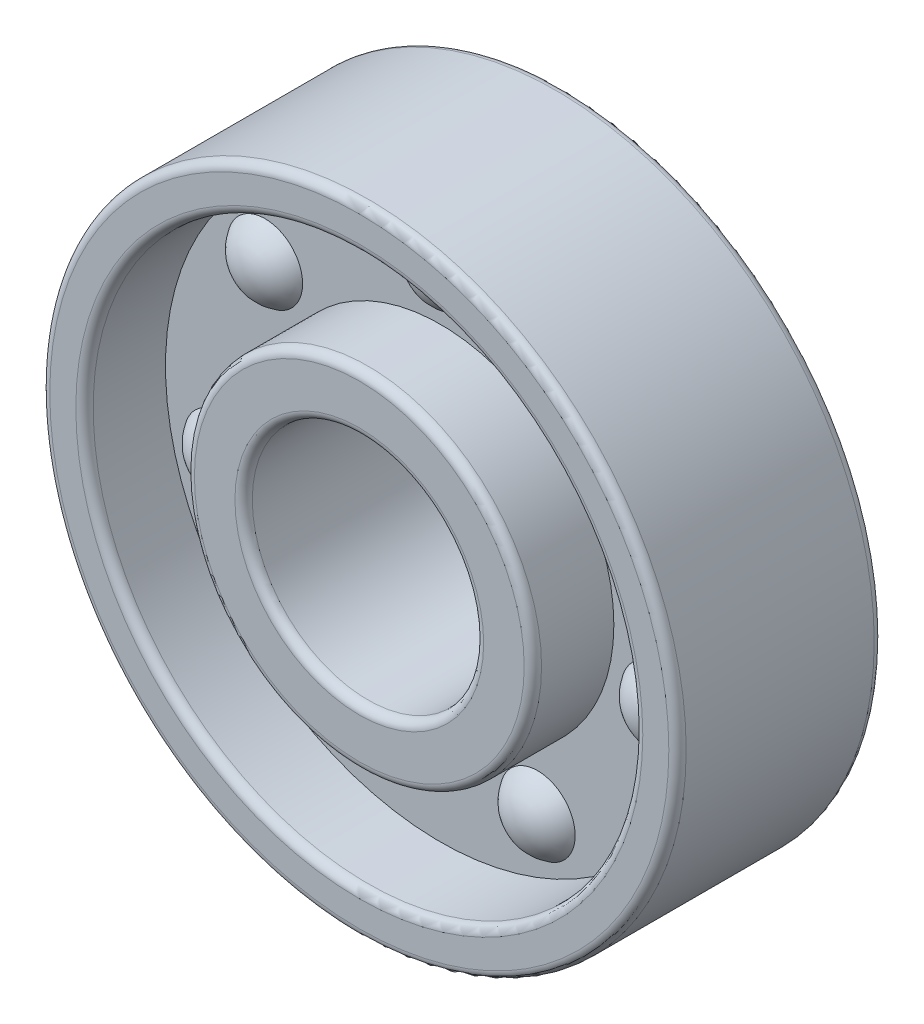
ISO-10303-21;
HEADER;
FILE_DESCRIPTION(('STEP AP214'),'2;1');
FILE_NAME('part.step','',(''),(''),'','','');
FILE_SCHEMA(('AUTOMOTIVE_DESIGN { 1 0 10303 214 1 1 1 1 }'));
ENDSEC;
DATA;
#1=APPLICATION_CONTEXT('core data for automotive mechanical design processes');
#2=APPLICATION_PROTOCOL_DEFINITION('international standard','automotive_design',2000,#1);
#3=PRODUCT_CONTEXT('',#1,'mechanical');
#4=PRODUCT('Part','Part','',(#3));
#5=PRODUCT_RELATED_PRODUCT_CATEGORY('part','',(#4));
#6=PRODUCT_DEFINITION_FORMATION('','',#4);
#7=PRODUCT_DEFINITION_CONTEXT('part definition',#1,'design');
#8=PRODUCT_DEFINITION('design','',#6,#7);
#9=PRODUCT_DEFINITION_SHAPE('','',#8);
#10=(LENGTH_UNIT() NAMED_UNIT(*) SI_UNIT(.MILLI.,.METRE.));
#11=(NAMED_UNIT(*) PLANE_ANGLE_UNIT() SI_UNIT($,.RADIAN.));
#12=(NAMED_UNIT(*) SI_UNIT($,.STERADIAN.) SOLID_ANGLE_UNIT());
#13=UNCERTAINTY_MEASURE_WITH_UNIT(LENGTH_MEASURE(1.E-05),#10,'distance_accuracy_value','');
#14=(GEOMETRIC_REPRESENTATION_CONTEXT(3) GLOBAL_UNCERTAINTY_ASSIGNED_CONTEXT((#13)) GLOBAL_UNIT_ASSIGNED_CONTEXT((#10,
#11,#12)) REPRESENTATION_CONTEXT('',''));
#15=CARTESIAN_POINT('',(0.,0.,0.));
#16=DIRECTION('',(0.,0.,1.));
#17=DIRECTION('',(1.,0.,0.));
#18=AXIS2_PLACEMENT_3D('',#15,#16,#17);
#19=CARTESIAN_POINT('',(0.,0.,7.1));
#20=DIRECTION('',(0.,0.,1.));
#21=DIRECTION('',(1.,0.,0.));
#22=AXIS2_PLACEMENT_3D('',#19,#20,#21);
#23=PLANE('',#22);
#24=CARTESIAN_POINT('',(0.,0.,7.1));
#25=DIRECTION('',(0.,0.,1.));
#26=DIRECTION('',(1.,0.,0.));
#27=AXIS2_PLACEMENT_3D('',#24,#25,#26);
#28=CIRCLE('',#27,9.8);
#29=CARTESIAN_POINT('',(9.8,0.,7.1));
#30=VERTEX_POINT('',#29);
#31=EDGE_CURVE('E74',#30,#30,#28,.F.);
#32=ORIENTED_EDGE('',*,*,#31,.T.);
#33=EDGE_LOOP('',(#32));
#34=FACE_BOUND('',#33,.T.);
#35=CARTESIAN_POINT('',(0.,0.,7.1));
#36=DIRECTION('',(0.,0.,1.));
#37=DIRECTION('',(1.,0.,0.));
#38=AXIS2_PLACEMENT_3D('',#35,#36,#37);
#39=CIRCLE('',#38,10.7);
#40=CARTESIAN_POINT('',(10.7,0.,7.1));
#41=VERTEX_POINT('',#40);
#42=EDGE_CURVE('E77',#41,#41,#39,.T.);
#43=ORIENTED_EDGE('',*,*,#42,.T.);
#44=EDGE_LOOP('',(#43));
#45=FACE_BOUND('',#44,.T.);
#46=ADVANCED_FACE('F39',(#34,#45),#23,.T.);
#47=CARTESIAN_POINT('',(0.,0.,0.));
#48=DIRECTION('',(0.,0.,1.));
#49=DIRECTION('',(1.,0.,0.));
#50=AXIS2_PLACEMENT_3D('',#47,#48,#49);
#51=PLANE('',#50);
#52=CARTESIAN_POINT('',(0.,0.,0.));
#53=DIRECTION('',(0.,0.,1.));
#54=DIRECTION('',(1.,0.,0.));
#55=AXIS2_PLACEMENT_3D('',#52,#53,#54);
#56=CIRCLE('',#55,9.8);
#57=CARTESIAN_POINT('',(9.8,0.,0.));
#58=VERTEX_POINT('',#57);
#59=EDGE_CURVE('E50',#58,#58,#56,.T.);
#60=ORIENTED_EDGE('',*,*,#59,.T.);
#61=EDGE_LOOP('',(#60));
#62=FACE_BOUND('',#61,.T.);
#63=CARTESIAN_POINT('',(0.,0.,0.));
#64=DIRECTION('',(0.,0.,1.));
#65=DIRECTION('',(1.,0.,0.));
#66=AXIS2_PLACEMENT_3D('',#63,#64,#65);
#67=CIRCLE('',#66,10.7);
#68=CARTESIAN_POINT('',(10.7,0.,0.));
#69=VERTEX_POINT('',#68);
#70=EDGE_CURVE('E54',#69,#69,#67,.F.);
#71=ORIENTED_EDGE('',*,*,#70,.T.);
#72=EDGE_LOOP('',(#71));
#73=FACE_BOUND('',#72,.T.);
#74=ADVANCED_FACE('F169',(#62,#73),#51,.F.);
#75=CARTESIAN_POINT('',(0.,0.,7.1));
#76=DIRECTION('',(0.,0.,-1.));
#77=DIRECTION('',(-1.,0.,0.));
#78=AXIS2_PLACEMENT_3D('',#75,#76,#77);
#79=CYLINDRICAL_SURFACE('',#78,11.);
#80=CARTESIAN_POINT('',(0.,0.,6.8));
#81=DIRECTION('',(0.,0.,1.));
#82=DIRECTION('',(1.,0.,0.));
#83=AXIS2_PLACEMENT_3D('',#80,#81,#82);
#84=CIRCLE('',#83,11.);
#85=CARTESIAN_POINT('',(11.,0.,6.8));
#86=VERTEX_POINT('',#85);
#87=EDGE_CURVE('E10',#86,#86,#84,.F.);
#88=ORIENTED_EDGE('',*,*,#87,.T.);
#89=EDGE_LOOP('',(#88));
#90=FACE_BOUND('',#89,.T.);
#91=CARTESIAN_POINT('',(0.,0.,0.3));
#92=DIRECTION('',(0.,0.,1.));
#93=DIRECTION('',(1.,0.,0.));
#94=AXIS2_PLACEMENT_3D('',#91,#92,#93);
#95=CIRCLE('',#94,11.);
#96=CARTESIAN_POINT('',(11.,0.,0.3));
#97=VERTEX_POINT('',#96);
#98=EDGE_CURVE('E46',#97,#97,#95,.T.);
#99=ORIENTED_EDGE('',*,*,#98,.T.);
#100=EDGE_LOOP('',(#99));
#101=FACE_BOUND('',#100,.T.);
#102=ADVANCED_FACE('F176',(#90,#101),#79,.T.);
#103=CARTESIAN_POINT('',(0.,0.,7.1));
#104=DIRECTION('',(0.,0.,1.));
#105=DIRECTION('',(1.,0.,0.));
#106=AXIS2_PLACEMENT_3D('',#103,#104,#105);
#107=CYLINDRICAL_SURFACE('',#106,9.5);
#108=CARTESIAN_POINT('',(0.,0.,0.3));
#109=DIRECTION('',(0.,0.,1.));
#110=DIRECTION('',(1.,0.,0.));
#111=AXIS2_PLACEMENT_3D('',#108,#109,#110);
#112=CIRCLE('',#111,9.5);
#113=CARTESIAN_POINT('',(9.5,0.,0.3));
#114=VERTEX_POINT('',#113);
#115=EDGE_CURVE('E59',#114,#114,#112,.F.);
#116=ORIENTED_EDGE('',*,*,#115,.T.);
#117=EDGE_LOOP('',(#116));
#118=FACE_BOUND('',#117,.T.);
#119=CARTESIAN_POINT('',(0.,0.,2.8));
#120=DIRECTION('',(0.,0.,1.));
#121=DIRECTION('',(1.,0.,0.));
#122=AXIS2_PLACEMENT_3D('',#119,#120,#121);
#123=CIRCLE('',#122,9.5);
#124=CARTESIAN_POINT('',(9.5,0.,2.8));
#125=VERTEX_POINT('',#124);
#126=EDGE_CURVE('E124',#125,#125,#123,.T.);
#127=ORIENTED_EDGE('',*,*,#126,.T.);
#128=EDGE_LOOP('',(#127));
#129=FACE_BOUND('',#128,.T.);
#130=ADVANCED_FACE('F329',(#118,#129),#107,.F.);
#131=CARTESIAN_POINT('',(0.,0.,7.1));
#132=DIRECTION('',(0.,0.,1.));
#133=DIRECTION('',(1.,0.,0.));
#134=AXIS2_PLACEMENT_3D('',#131,#132,#133);
#135=CYLINDRICAL_SURFACE('',#134,6.);
#136=CARTESIAN_POINT('',(0.,0.,0.3));
#137=DIRECTION('',(0.,0.,1.));
#138=DIRECTION('',(1.,0.,0.));
#139=AXIS2_PLACEMENT_3D('',#136,#137,#138);
#140=CIRCLE('',#139,6.);
#141=CARTESIAN_POINT('',(6.,0.,0.3));
#142=VERTEX_POINT('',#141);
#143=EDGE_CURVE('E62',#142,#142,#140,.T.);
#144=ORIENTED_EDGE('',*,*,#143,.T.);
#145=EDGE_LOOP('',(#144));
#146=FACE_BOUND('',#145,.T.);
#147=CARTESIAN_POINT('',(0.,0.,2.8));
#148=DIRECTION('',(0.,0.,1.));
#149=DIRECTION('',(1.,0.,0.));
#150=AXIS2_PLACEMENT_3D('',#147,#148,#149);
#151=CIRCLE('',#150,6.);
#152=CARTESIAN_POINT('',(6.,0.,2.8));
#153=VERTEX_POINT('',#152);
#154=EDGE_CURVE('E128',#153,#153,#151,.T.);
#155=ORIENTED_EDGE('',*,*,#154,.F.);
#156=EDGE_LOOP('',(#155));
#157=FACE_BOUND('',#156,.T.);
#158=ADVANCED_FACE('F324',(#146,#157),#135,.T.);
#159=CARTESIAN_POINT('',(0.,9.5,2.8));
#160=DIRECTION('',(0.,0.,-1.));
#161=DIRECTION('',(-1.,0.,0.));
#162=AXIS2_PLACEMENT_3D('',#159,#160,#161);
#163=PLANE('',#162);
#164=CARTESIAN_POINT('',(-6.05919398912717,4.83204596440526,2.8));
#165=DIRECTION('',(0.,0.,-1.));
#166=DIRECTION('',(-1.,0.,0.));
#167=AXIS2_PLACEMENT_3D('',#164,#165,#166);
#168=CIRCLE('',#167,1.29903810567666);
#169=CARTESIAN_POINT('',(-7.35823209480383,4.83204596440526,2.8));
#170=VERTEX_POINT('',#169);
#171=EDGE_CURVE('E99',#170,#170,#168,.F.);
#172=ORIENTED_EDGE('',*,*,#171,.T.);
#173=EDGE_LOOP('',(#172));
#174=FACE_BOUND('',#173,.T.);
#175=CARTESIAN_POINT('',(-7.55569131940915,-1.72453723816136,2.8));
#176=DIRECTION('',(0.,0.,-1.));
#177=DIRECTION('',(-1.,0.,0.));
#178=AXIS2_PLACEMENT_3D('',#175,#176,#177);
#179=CIRCLE('',#178,1.29903810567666);
#180=CARTESIAN_POINT('',(-8.85472942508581,-1.72453723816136,2.8));
#181=VERTEX_POINT('',#180);
#182=EDGE_CURVE('E103',#181,#181,#179,.F.);
#183=ORIENTED_EDGE('',*,*,#182,.T.);
#184=EDGE_LOOP('',(#183));
#185=FACE_BOUND('',#184,.T.);
#186=CARTESIAN_POINT('',(-3.36259897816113,-6.98250872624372,2.8));
#187=DIRECTION('',(0.,0.,-1.));
#188=DIRECTION('',(-1.,0.,0.));
#189=AXIS2_PLACEMENT_3D('',#186,#187,#188);
#190=CIRCLE('',#189,1.29903810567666);
#191=CARTESIAN_POINT('',(-4.66163708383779,-6.98250872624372,2.8));
#192=VERTEX_POINT('',#191);
#193=EDGE_CURVE('E107',#192,#192,#190,.F.);
#194=ORIENTED_EDGE('',*,*,#193,.T.);
#195=EDGE_LOOP('',(#194));
#196=FACE_BOUND('',#195,.T.);
#197=CARTESIAN_POINT('',(3.36259897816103,-6.98250872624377,2.8));
#198=DIRECTION('',(0.,0.,-1.));
#199=DIRECTION('',(-1.,0.,0.));
#200=AXIS2_PLACEMENT_3D('',#197,#198,#199);
#201=CIRCLE('',#200,1.29903810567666);
#202=CARTESIAN_POINT('',(2.06356087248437,-6.98250872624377,2.8));
#203=VERTEX_POINT('',#202);
#204=EDGE_CURVE('E111',#203,#203,#201,.F.);
#205=ORIENTED_EDGE('',*,*,#204,.T.);
#206=EDGE_LOOP('',(#205));
#207=FACE_BOUND('',#206,.T.);
#208=CARTESIAN_POINT('',(7.55569131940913,-1.72453723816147,2.8));
#209=DIRECTION('',(0.,0.,-1.));
#210=DIRECTION('',(-1.,0.,0.));
#211=AXIS2_PLACEMENT_3D('',#208,#209,#210);
#212=CIRCLE('',#211,1.29903810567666);
#213=CARTESIAN_POINT('',(6.25665321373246,-1.72453723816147,2.8));
#214=VERTEX_POINT('',#213);
#215=EDGE_CURVE('E115',#214,#214,#212,.F.);
#216=ORIENTED_EDGE('',*,*,#215,.T.);
#217=EDGE_LOOP('',(#216));
#218=FACE_BOUND('',#217,.T.);
#219=CARTESIAN_POINT('',(6.05919398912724,4.83204596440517,2.8));
#220=DIRECTION('',(0.,0.,-1.));
#221=DIRECTION('',(-1.,0.,0.));
#222=AXIS2_PLACEMENT_3D('',#219,#220,#221);
#223=CIRCLE('',#222,1.29903810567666);
#224=CARTESIAN_POINT('',(4.76015588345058,4.83204596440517,2.8));
#225=VERTEX_POINT('',#224);
#226=EDGE_CURVE('E119',#225,#225,#223,.F.);
#227=ORIENTED_EDGE('',*,*,#226,.T.);
#228=EDGE_LOOP('',(#227));
#229=FACE_BOUND('',#228,.T.);
#230=CARTESIAN_POINT('',(0.,7.75,2.8));
#231=DIRECTION('',(0.,0.,-1.));
#232=DIRECTION('',(-1.,0.,0.));
#233=AXIS2_PLACEMENT_3D('',#230,#231,#232);
#234=CIRCLE('',#233,1.29903810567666);
#235=CARTESIAN_POINT('',(-1.29903810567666,7.75,2.8));
#236=VERTEX_POINT('',#235);
#237=EDGE_CURVE('E123',#236,#236,#234,.F.);
#238=ORIENTED_EDGE('',*,*,#237,.T.);
#239=EDGE_LOOP('',(#238));
#240=FACE_BOUND('',#239,.T.);
#241=ORIENTED_EDGE('',*,*,#154,.T.);
#242=EDGE_LOOP('',(#241));
#243=FACE_BOUND('',#242,.T.);
#244=ORIENTED_EDGE('',*,*,#126,.F.);
#245=EDGE_LOOP('',(#244));
#246=FACE_BOUND('',#245,.T.);
#247=ADVANCED_FACE('F150',(#174,#185,#196,#207,#218,#229,#240,#243,#246),#163,.T.);
#248=CARTESIAN_POINT('',(0.,0.,7.1));
#249=DIRECTION('',(0.,0.,1.));
#250=DIRECTION('',(1.,0.,0.));
#251=AXIS2_PLACEMENT_3D('',#248,#249,#250);
#252=CYLINDRICAL_SURFACE('',#251,9.5);
#253=CARTESIAN_POINT('',(0.,0.,6.8));
#254=DIRECTION('',(0.,0.,1.));
#255=DIRECTION('',(1.,0.,0.));
#256=AXIS2_PLACEMENT_3D('',#253,#254,#255);
#257=CIRCLE('',#256,9.5);
#258=CARTESIAN_POINT('',(9.5,0.,6.8));
#259=VERTEX_POINT('',#258);
#260=EDGE_CURVE('E71',#259,#259,#257,.T.);
#261=ORIENTED_EDGE('',*,*,#260,.T.);
#262=EDGE_LOOP('',(#261));
#263=FACE_BOUND('',#262,.T.);
#264=CARTESIAN_POINT('',(0.,0.,4.29999999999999));
#265=DIRECTION('',(0.,0.,1.));
#266=DIRECTION('',(1.,0.,0.));
#267=AXIS2_PLACEMENT_3D('',#264,#265,#266);
#268=CIRCLE('',#267,9.5);
#269=CARTESIAN_POINT('',(9.5,0.,4.29999999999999));
#270=VERTEX_POINT('',#269);
#271=EDGE_CURVE('E127',#270,#270,#268,.T.);
#272=ORIENTED_EDGE('',*,*,#271,.F.);
#273=EDGE_LOOP('',(#272));
#274=FACE_BOUND('',#273,.T.);
#275=ADVANCED_FACE('F306',(#263,#274),#252,.F.);
#276=CARTESIAN_POINT('',(0.,0.,7.1));
#277=DIRECTION('',(0.,0.,1.));
#278=DIRECTION('',(1.,0.,0.));
#279=AXIS2_PLACEMENT_3D('',#276,#277,#278);
#280=CYLINDRICAL_SURFACE('',#279,6.);
#281=CARTESIAN_POINT('',(0.,0.,6.8));
#282=DIRECTION('',(0.,0.,1.));
#283=DIRECTION('',(1.,0.,0.));
#284=AXIS2_PLACEMENT_3D('',#281,#282,#283);
#285=CIRCLE('',#284,6.);
#286=CARTESIAN_POINT('',(6.,0.,6.8));
#287=VERTEX_POINT('',#286);
#288=EDGE_CURVE('E80',#287,#287,#285,.F.);
#289=ORIENTED_EDGE('',*,*,#288,.T.);
#290=EDGE_LOOP('',(#289));
#291=FACE_BOUND('',#290,.T.);
#292=CARTESIAN_POINT('',(0.,0.,4.29999999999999));
#293=DIRECTION('',(0.,0.,1.));
#294=DIRECTION('',(1.,0.,0.));
#295=AXIS2_PLACEMENT_3D('',#292,#293,#294);
#296=CIRCLE('',#295,6.);
#297=CARTESIAN_POINT('',(6.,0.,4.29999999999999));
#298=VERTEX_POINT('',#297);
#299=EDGE_CURVE('E95',#298,#298,#296,.T.);
#300=ORIENTED_EDGE('',*,*,#299,.T.);
#301=EDGE_LOOP('',(#300));
#302=FACE_BOUND('',#301,.T.);
#303=ADVANCED_FACE('F191',(#291,#302),#280,.T.);
#304=CARTESIAN_POINT('',(0.,9.5,4.29999999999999));
#305=DIRECTION('',(0.,0.,1.));
#306=DIRECTION('',(1.,0.,0.));
#307=AXIS2_PLACEMENT_3D('',#304,#305,#306);
#308=PLANE('',#307);
#309=CARTESIAN_POINT('',(-6.05919398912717,4.83204596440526,4.29999999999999));
#310=DIRECTION('',(0.,0.,1.));
#311=DIRECTION('',(1.,0.,0.));
#312=AXIS2_PLACEMENT_3D('',#309,#310,#311);
#313=CIRCLE('',#312,1.29903810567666);
#314=CARTESIAN_POINT('',(-4.76015588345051,4.83204596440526,4.29999999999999));
#315=VERTEX_POINT('',#314);
#316=EDGE_CURVE('E96',#315,#315,#313,.F.);
#317=ORIENTED_EDGE('',*,*,#316,.T.);
#318=EDGE_LOOP('',(#317));
#319=FACE_BOUND('',#318,.T.);
#320=CARTESIAN_POINT('',(-7.55569131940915,-1.72453723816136,4.29999999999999));
#321=DIRECTION('',(0.,0.,1.));
#322=DIRECTION('',(1.,0.,0.));
#323=AXIS2_PLACEMENT_3D('',#320,#321,#322);
#324=CIRCLE('',#323,1.29903810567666);
#325=CARTESIAN_POINT('',(-6.25665321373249,-1.72453723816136,4.29999999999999));
#326=VERTEX_POINT('',#325);
#327=EDGE_CURVE('E100',#326,#326,#324,.F.);
#328=ORIENTED_EDGE('',*,*,#327,.T.);
#329=EDGE_LOOP('',(#328));
#330=FACE_BOUND('',#329,.T.);
#331=CARTESIAN_POINT('',(-3.36259897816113,-6.98250872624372,4.29999999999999));
#332=DIRECTION('',(0.,0.,1.));
#333=DIRECTION('',(1.,0.,0.));
#334=AXIS2_PLACEMENT_3D('',#331,#332,#333);
#335=CIRCLE('',#334,1.29903810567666);
#336=CARTESIAN_POINT('',(-2.06356087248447,-6.98250872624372,4.29999999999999));
#337=VERTEX_POINT('',#336);
#338=EDGE_CURVE('E104',#337,#337,#335,.F.);
#339=ORIENTED_EDGE('',*,*,#338,.T.);
#340=EDGE_LOOP('',(#339));
#341=FACE_BOUND('',#340,.T.);
#342=CARTESIAN_POINT('',(3.36259897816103,-6.98250872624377,4.29999999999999));
#343=DIRECTION('',(0.,0.,1.));
#344=DIRECTION('',(1.,0.,0.));
#345=AXIS2_PLACEMENT_3D('',#342,#343,#344);
#346=CIRCLE('',#345,1.29903810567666);
#347=CARTESIAN_POINT('',(4.66163708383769,-6.98250872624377,4.29999999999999));
#348=VERTEX_POINT('',#347);
#349=EDGE_CURVE('E108',#348,#348,#346,.F.);
#350=ORIENTED_EDGE('',*,*,#349,.T.);
#351=EDGE_LOOP('',(#350));
#352=FACE_BOUND('',#351,.T.);
#353=CARTESIAN_POINT('',(7.55569131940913,-1.72453723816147,4.29999999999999));
#354=DIRECTION('',(0.,0.,1.));
#355=DIRECTION('',(1.,0.,0.));
#356=AXIS2_PLACEMENT_3D('',#353,#354,#355);
#357=CIRCLE('',#356,1.29903810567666);
#358=CARTESIAN_POINT('',(8.85472942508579,-1.72453723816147,4.29999999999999));
#359=VERTEX_POINT('',#358);
#360=EDGE_CURVE('E112',#359,#359,#357,.F.);
#361=ORIENTED_EDGE('',*,*,#360,.T.);
#362=EDGE_LOOP('',(#361));
#363=FACE_BOUND('',#362,.T.);
#364=CARTESIAN_POINT('',(6.05919398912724,4.83204596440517,4.29999999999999));
#365=DIRECTION('',(0.,0.,1.));
#366=DIRECTION('',(1.,0.,0.));
#367=AXIS2_PLACEMENT_3D('',#364,#365,#366);
#368=CIRCLE('',#367,1.29903810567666);
#369=CARTESIAN_POINT('',(7.3582320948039,4.83204596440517,4.29999999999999));
#370=VERTEX_POINT('',#369);
#371=EDGE_CURVE('E116',#370,#370,#368,.F.);
#372=ORIENTED_EDGE('',*,*,#371,.T.);
#373=EDGE_LOOP('',(#372));
#374=FACE_BOUND('',#373,.T.);
#375=CARTESIAN_POINT('',(0.,7.75,4.29999999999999));
#376=DIRECTION('',(0.,0.,1.));
#377=DIRECTION('',(1.,0.,0.));
#378=AXIS2_PLACEMENT_3D('',#375,#376,#377);
#379=CIRCLE('',#378,1.29903810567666);
#380=CARTESIAN_POINT('',(1.29903810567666,7.75,4.29999999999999));
#381=VERTEX_POINT('',#380);
#382=EDGE_CURVE('E120',#381,#381,#379,.F.);
#383=ORIENTED_EDGE('',*,*,#382,.T.);
#384=EDGE_LOOP('',(#383));
#385=FACE_BOUND('',#384,.T.);
#386=ORIENTED_EDGE('',*,*,#271,.T.);
#387=EDGE_LOOP('',(#386));
#388=FACE_BOUND('',#387,.T.);
#389=ORIENTED_EDGE('',*,*,#299,.F.);
#390=EDGE_LOOP('',(#389));
#391=FACE_BOUND('',#390,.T.);
#392=ADVANCED_FACE('F184',(#319,#330,#341,#352,#363,#374,#385,#388,#391),#308,.T.);
#393=CARTESIAN_POINT('',(0.,0.,7.1));
#394=DIRECTION('',(0.,0.,1.));
#395=DIRECTION('',(1.,0.,0.));
#396=AXIS2_PLACEMENT_3D('',#393,#394,#395);
#397=CIRCLE('',#396,4.3);
#398=CARTESIAN_POINT('',(4.3,0.,7.1));
#399=VERTEX_POINT('',#398);
#400=EDGE_CURVE('E83',#399,#399,#397,.F.);
#401=ORIENTED_EDGE('',*,*,#400,.T.);
#402=EDGE_LOOP('',(#401));
#403=FACE_BOUND('',#402,.T.);
#404=CARTESIAN_POINT('',(0.,0.,7.1));
#405=DIRECTION('',(0.,0.,1.));
#406=DIRECTION('',(1.,0.,0.));
#407=AXIS2_PLACEMENT_3D('',#404,#405,#406);
#408=CIRCLE('',#407,5.7);
#409=CARTESIAN_POINT('',(5.7,0.,7.1));
#410=VERTEX_POINT('',#409);
#411=EDGE_CURVE('E86',#410,#410,#408,.T.);
#412=ORIENTED_EDGE('',*,*,#411,.T.);
#413=EDGE_LOOP('',(#412));
#414=FACE_BOUND('',#413,.T.);
#415=ADVANCED_FACE('F172',(#403,#414),#23,.T.);
#416=CARTESIAN_POINT('',(0.,0.,7.1));
#417=DIRECTION('',(0.,0.,-1.));
#418=DIRECTION('',(-1.,0.,0.));
#419=AXIS2_PLACEMENT_3D('',#416,#417,#418);
#420=CYLINDRICAL_SURFACE('',#419,4.);
#421=CARTESIAN_POINT('',(0.,0.,6.8));
#422=DIRECTION('',(0.,0.,1.));
#423=DIRECTION('',(1.,0.,0.));
#424=AXIS2_PLACEMENT_3D('',#421,#422,#423);
#425=CIRCLE('',#424,4.);
#426=CARTESIAN_POINT('',(4.,0.,6.8));
#427=VERTEX_POINT('',#426);
#428=EDGE_CURVE('E89',#427,#427,#425,.T.);
#429=ORIENTED_EDGE('',*,*,#428,.T.);
#430=EDGE_LOOP('',(#429));
#431=FACE_BOUND('',#430,.T.);
#432=CARTESIAN_POINT('',(0.,0.,0.3));
#433=DIRECTION('',(0.,0.,1.));
#434=DIRECTION('',(1.,0.,0.));
#435=AXIS2_PLACEMENT_3D('',#432,#433,#434);
#436=CIRCLE('',#435,4.);
#437=CARTESIAN_POINT('',(4.,0.,0.3));
#438=VERTEX_POINT('',#437);
#439=EDGE_CURVE('E92',#438,#438,#436,.F.);
#440=ORIENTED_EDGE('',*,*,#439,.T.);
#441=EDGE_LOOP('',(#440));
#442=FACE_BOUND('',#441,.T.);
#443=ADVANCED_FACE('F183',(#431,#442),#420,.F.);
#444=CARTESIAN_POINT('',(0.,0.,0.));
#445=DIRECTION('',(0.,0.,1.));
#446=DIRECTION('',(1.,0.,0.));
#447=AXIS2_PLACEMENT_3D('',#444,#445,#446);
#448=CIRCLE('',#447,4.3);
#449=CARTESIAN_POINT('',(4.3,0.,0.));
#450=VERTEX_POINT('',#449);
#451=EDGE_CURVE('E65',#450,#450,#448,.T.);
#452=ORIENTED_EDGE('',*,*,#451,.T.);
#453=EDGE_LOOP('',(#452));
#454=FACE_BOUND('',#453,.T.);
#455=CARTESIAN_POINT('',(0.,0.,0.));
#456=DIRECTION('',(0.,0.,1.));
#457=DIRECTION('',(1.,0.,0.));
#458=AXIS2_PLACEMENT_3D('',#455,#456,#457);
#459=CIRCLE('',#458,5.7);
#460=CARTESIAN_POINT('',(5.7,0.,0.));
#461=VERTEX_POINT('',#460);
#462=EDGE_CURVE('E68',#461,#461,#459,.F.);
#463=ORIENTED_EDGE('',*,*,#462,.T.);
#464=EDGE_LOOP('',(#463));
#465=FACE_BOUND('',#464,.T.);
#466=ADVANCED_FACE('F179',(#454,#465),#51,.F.);
#467=CARTESIAN_POINT('',(0.,7.75,3.55));
#468=DIRECTION('',(0.,1.,0.));
#469=DIRECTION('',(0.,0.,-1.));
#470=AXIS2_PLACEMENT_3D('',#467,#468,#469);
#471=SPHERICAL_SURFACE('',#470,1.5);
#472=CARTESIAN_POINT('',(0.,7.75,3.55));
#473=DIRECTION('',(0.,0.,1.));
#474=DIRECTION('',(1.,0.,0.));
#475=AXIS2_PLACEMENT_3D('',#472,#473,#474);
#476=SPHERICAL_SURFACE('',#475,1.5);
#477=ORIENTED_EDGE('',*,*,#382,.F.);
#478=EDGE_LOOP('',(#477));
#479=FACE_BOUND('',#478,.T.);
#480=ADVANCED_FACE('F283',(#479),#476,.T.);
#481=CARTESIAN_POINT('',(0.,7.75,3.55));
#482=DIRECTION('',(0.,0.,-1.));
#483=DIRECTION('',(-1.,0.,0.));
#484=AXIS2_PLACEMENT_3D('',#481,#482,#483);
#485=SPHERICAL_SURFACE('',#484,1.5);
#486=ORIENTED_EDGE('',*,*,#237,.F.);
#487=EDGE_LOOP('',(#486));
#488=FACE_BOUND('',#487,.T.);
#489=ADVANCED_FACE('F456',(#488),#485,.T.);
#490=CARTESIAN_POINT('',(6.05919398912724,4.83204596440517,3.55));
#491=DIRECTION('',(0.781831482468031,0.623489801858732,0.));
#492=DIRECTION('',(0.,0.,-1.));
#493=AXIS2_PLACEMENT_3D('',#490,#491,#492);
#494=SPHERICAL_SURFACE('',#493,1.5);
#495=CARTESIAN_POINT('',(6.05919398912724,4.83204596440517,3.55));
#496=DIRECTION('',(0.,0.,1.));
#497=DIRECTION('',(1.,0.,0.));
#498=AXIS2_PLACEMENT_3D('',#495,#496,#497);
#499=SPHERICAL_SURFACE('',#498,1.5);
#500=ORIENTED_EDGE('',*,*,#371,.F.);
#501=EDGE_LOOP('',(#500));
#502=FACE_BOUND('',#501,.T.);
#503=ADVANCED_FACE('F446',(#502),#499,.T.);
#504=CARTESIAN_POINT('',(6.05919398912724,4.83204596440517,3.55));
#505=DIRECTION('',(0.,0.,-1.));
#506=DIRECTION('',(-1.,0.,0.));
#507=AXIS2_PLACEMENT_3D('',#504,#505,#506);
#508=SPHERICAL_SURFACE('',#507,1.5);
#509=ORIENTED_EDGE('',*,*,#226,.F.);
#510=EDGE_LOOP('',(#509));
#511=FACE_BOUND('',#510,.T.);
#512=ADVANCED_FACE('F437',(#511),#508,.T.);
#513=CARTESIAN_POINT('',(7.55569131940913,-1.72453723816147,3.55));
#514=DIRECTION('',(0.974927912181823,-0.222520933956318,0.));
#515=DIRECTION('',(0.,0.,-1.));
#516=AXIS2_PLACEMENT_3D('',#513,#514,#515);
#517=SPHERICAL_SURFACE('',#516,1.5);
#518=CARTESIAN_POINT('',(7.55569131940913,-1.72453723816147,3.55));
#519=DIRECTION('',(0.,0.,1.));
#520=DIRECTION('',(1.,0.,0.));
#521=AXIS2_PLACEMENT_3D('',#518,#519,#520);
#522=SPHERICAL_SURFACE('',#521,1.5);
#523=ORIENTED_EDGE('',*,*,#360,.F.);
#524=EDGE_LOOP('',(#523));
#525=FACE_BOUND('',#524,.T.);
#526=ADVANCED_FACE('F427',(#525),#522,.T.);
#527=CARTESIAN_POINT('',(7.55569131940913,-1.72453723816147,3.55));
#528=DIRECTION('',(0.,0.,-1.));
#529=DIRECTION('',(-1.,0.,0.));
#530=AXIS2_PLACEMENT_3D('',#527,#528,#529);
#531=SPHERICAL_SURFACE('',#530,1.5);
#532=ORIENTED_EDGE('',*,*,#215,.F.);
#533=EDGE_LOOP('',(#532));
#534=FACE_BOUND('',#533,.T.);
#535=ADVANCED_FACE('F418',(#534),#531,.T.);
#536=CARTESIAN_POINT('',(3.36259897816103,-6.98250872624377,3.55));
#537=DIRECTION('',(0.433883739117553,-0.900968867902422,0.));
#538=DIRECTION('',(0.,0.,-1.));
#539=AXIS2_PLACEMENT_3D('',#536,#537,#538);
#540=SPHERICAL_SURFACE('',#539,1.5);
#541=CARTESIAN_POINT('',(3.36259897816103,-6.98250872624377,3.55));
#542=DIRECTION('',(0.,0.,1.));
#543=DIRECTION('',(1.,0.,0.));
#544=AXIS2_PLACEMENT_3D('',#541,#542,#543);
#545=SPHERICAL_SURFACE('',#544,1.5);
#546=ORIENTED_EDGE('',*,*,#349,.F.);
#547=EDGE_LOOP('',(#546));
#548=FACE_BOUND('',#547,.T.);
#549=ADVANCED_FACE('F408',(#548),#545,.T.);
#550=CARTESIAN_POINT('',(3.36259897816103,-6.98250872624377,3.55));
#551=DIRECTION('',(0.,0.,-1.));
#552=DIRECTION('',(-1.,0.,0.));
#553=AXIS2_PLACEMENT_3D('',#550,#551,#552);
#554=SPHERICAL_SURFACE('',#553,1.5);
#555=ORIENTED_EDGE('',*,*,#204,.F.);
#556=EDGE_LOOP('',(#555));
#557=FACE_BOUND('',#556,.T.);
#558=ADVANCED_FACE('F399',(#557),#554,.T.);
#559=CARTESIAN_POINT('',(-3.36259897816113,-6.98250872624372,3.55));
#560=DIRECTION('',(-0.433883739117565,-0.900968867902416,0.));
#561=DIRECTION('',(0.,0.,-1.));
#562=AXIS2_PLACEMENT_3D('',#559,#560,#561);
#563=SPHERICAL_SURFACE('',#562,1.5);
#564=CARTESIAN_POINT('',(-3.36259897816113,-6.98250872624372,3.55));
#565=DIRECTION('',(0.,0.,1.));
#566=DIRECTION('',(1.,0.,0.));
#567=AXIS2_PLACEMENT_3D('',#564,#565,#566);
#568=SPHERICAL_SURFACE('',#567,1.5);
#569=ORIENTED_EDGE('',*,*,#338,.F.);
#570=EDGE_LOOP('',(#569));
#571=FACE_BOUND('',#570,.T.);
#572=ADVANCED_FACE('F389',(#571),#568,.T.);
#573=CARTESIAN_POINT('',(-3.36259897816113,-6.98250872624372,3.55));
#574=DIRECTION('',(0.,0.,-1.));
#575=DIRECTION('',(-1.,0.,0.));
#576=AXIS2_PLACEMENT_3D('',#573,#574,#575);
#577=SPHERICAL_SURFACE('',#576,1.5);
#578=ORIENTED_EDGE('',*,*,#193,.F.);
#579=EDGE_LOOP('',(#578));
#580=FACE_BOUND('',#579,.T.);
#581=ADVANCED_FACE('F380',(#580),#577,.T.);
#582=CARTESIAN_POINT('',(-7.55569131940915,-1.72453723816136,3.55));
#583=DIRECTION('',(-0.974927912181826,-0.222520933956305,0.));
#584=DIRECTION('',(0.,0.,-1.));
#585=AXIS2_PLACEMENT_3D('',#582,#583,#584);
#586=SPHERICAL_SURFACE('',#585,1.5);
#587=CARTESIAN_POINT('',(-7.55569131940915,-1.72453723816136,3.55));
#588=DIRECTION('',(0.,0.,1.));
#589=DIRECTION('',(1.,0.,0.));
#590=AXIS2_PLACEMENT_3D('',#587,#588,#589);
#591=SPHERICAL_SURFACE('',#590,1.5);
#592=ORIENTED_EDGE('',*,*,#327,.F.);
#593=EDGE_LOOP('',(#592));
#594=FACE_BOUND('',#593,.T.);
#595=ADVANCED_FACE('F371',(#594),#591,.T.);
#596=CARTESIAN_POINT('',(-7.55569131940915,-1.72453723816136,3.55));
#597=DIRECTION('',(0.,0.,-1.));
#598=DIRECTION('',(-1.,0.,0.));
#599=AXIS2_PLACEMENT_3D('',#596,#597,#598);
#600=SPHERICAL_SURFACE('',#599,1.5);
#601=ORIENTED_EDGE('',*,*,#182,.F.);
#602=EDGE_LOOP('',(#601));
#603=FACE_BOUND('',#602,.T.);
#604=ADVANCED_FACE('F165',(#603),#600,.T.);
#605=CARTESIAN_POINT('',(-6.05919398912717,4.83204596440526,3.55));
#606=DIRECTION('',(-0.781831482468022,0.623489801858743,0.));
#607=DIRECTION('',(0.,0.,-1.));
#608=AXIS2_PLACEMENT_3D('',#605,#606,#607);
#609=SPHERICAL_SURFACE('',#608,1.5);
#610=CARTESIAN_POINT('',(-6.05919398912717,4.83204596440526,3.55));
#611=DIRECTION('',(0.,0.,1.));
#612=DIRECTION('',(1.,0.,0.));
#613=AXIS2_PLACEMENT_3D('',#610,#611,#612);
#614=SPHERICAL_SURFACE('',#613,1.5);
#615=ORIENTED_EDGE('',*,*,#316,.F.);
#616=EDGE_LOOP('',(#615));
#617=FACE_BOUND('',#616,.T.);
#618=ADVANCED_FACE('F156',(#617),#614,.T.);
#619=CARTESIAN_POINT('',(-6.05919398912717,4.83204596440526,3.55));
#620=DIRECTION('',(0.,0.,-1.));
#621=DIRECTION('',(-1.,0.,0.));
#622=AXIS2_PLACEMENT_3D('',#619,#620,#621);
#623=SPHERICAL_SURFACE('',#622,1.5);
#624=ORIENTED_EDGE('',*,*,#171,.F.);
#625=EDGE_LOOP('',(#624));
#626=FACE_BOUND('',#625,.T.);
#627=ADVANCED_FACE('F153',(#626),#623,.T.);
#628=CARTESIAN_POINT('',(0.,0.,6.8));
#629=DIRECTION('',(0.,0.,1.));
#630=DIRECTION('',(1.,0.,0.));
#631=AXIS2_PLACEMENT_3D('',#628,#629,#630);
#632=TOROIDAL_SURFACE('',#631,4.3,0.3);
#633=ORIENTED_EDGE('',*,*,#400,.F.);
#634=EDGE_LOOP('',(#633));
#635=FACE_BOUND('',#634,.T.);
#636=ORIENTED_EDGE('',*,*,#428,.F.);
#637=EDGE_LOOP('',(#636));
#638=FACE_BOUND('',#637,.T.);
#639=ADVANCED_FACE('F155',(#635,#638),#632,.T.);
#640=CARTESIAN_POINT('',(0.,0.,6.8));
#641=DIRECTION('',(0.,0.,1.));
#642=DIRECTION('',(1.,0.,0.));
#643=AXIS2_PLACEMENT_3D('',#640,#641,#642);
#644=TOROIDAL_SURFACE('',#643,5.7,0.3);
#645=ORIENTED_EDGE('',*,*,#288,.F.);
#646=EDGE_LOOP('',(#645));
#647=FACE_BOUND('',#646,.T.);
#648=ORIENTED_EDGE('',*,*,#411,.F.);
#649=EDGE_LOOP('',(#648));
#650=FACE_BOUND('',#649,.T.);
#651=ADVANCED_FACE('F162',(#647,#650),#644,.T.);
#652=CARTESIAN_POINT('',(0.,0.,6.8));
#653=DIRECTION('',(0.,0.,1.));
#654=DIRECTION('',(1.,0.,0.));
#655=AXIS2_PLACEMENT_3D('',#652,#653,#654);
#656=TOROIDAL_SURFACE('',#655,9.8,0.3);
#657=ORIENTED_EDGE('',*,*,#260,.F.);
#658=EDGE_LOOP('',(#657));
#659=FACE_BOUND('',#658,.T.);
#660=ORIENTED_EDGE('',*,*,#31,.F.);
#661=EDGE_LOOP('',(#660));
#662=FACE_BOUND('',#661,.T.);
#663=ADVANCED_FACE('F199',(#659,#662),#656,.T.);
#664=CARTESIAN_POINT('',(0.,0.,0.3));
#665=DIRECTION('',(0.,0.,1.));
#666=DIRECTION('',(1.,0.,0.));
#667=AXIS2_PLACEMENT_3D('',#664,#665,#666);
#668=TOROIDAL_SURFACE('',#667,4.3,0.3);
#669=ORIENTED_EDGE('',*,*,#439,.F.);
#670=EDGE_LOOP('',(#669));
#671=FACE_BOUND('',#670,.T.);
#672=ORIENTED_EDGE('',*,*,#451,.F.);
#673=EDGE_LOOP('',(#672));
#674=FACE_BOUND('',#673,.T.);
#675=ADVANCED_FACE('F205',(#671,#674),#668,.T.);
#676=CARTESIAN_POINT('',(0.,0.,0.3));
#677=DIRECTION('',(0.,0.,1.));
#678=DIRECTION('',(1.,0.,0.));
#679=AXIS2_PLACEMENT_3D('',#676,#677,#678);
#680=TOROIDAL_SURFACE('',#679,5.7,0.3);
#681=ORIENTED_EDGE('',*,*,#462,.F.);
#682=EDGE_LOOP('',(#681));
#683=FACE_BOUND('',#682,.T.);
#684=ORIENTED_EDGE('',*,*,#143,.F.);
#685=EDGE_LOOP('',(#684));
#686=FACE_BOUND('',#685,.T.);
#687=ADVANCED_FACE('F213',(#683,#686),#680,.T.);
#688=CARTESIAN_POINT('',(0.,0.,0.3));
#689=DIRECTION('',(0.,0.,1.));
#690=DIRECTION('',(1.,0.,0.));
#691=AXIS2_PLACEMENT_3D('',#688,#689,#690);
#692=TOROIDAL_SURFACE('',#691,9.8,0.3);
#693=ORIENTED_EDGE('',*,*,#59,.F.);
#694=EDGE_LOOP('',(#693));
#695=FACE_BOUND('',#694,.T.);
#696=ORIENTED_EDGE('',*,*,#115,.F.);
#697=EDGE_LOOP('',(#696));
#698=FACE_BOUND('',#697,.T.);
#699=ADVANCED_FACE('F217',(#695,#698),#692,.T.);
#700=CARTESIAN_POINT('',(0.,0.,6.8));
#701=DIRECTION('',(0.,0.,1.));
#702=DIRECTION('',(1.,0.,0.));
#703=AXIS2_PLACEMENT_3D('',#700,#701,#702);
#704=TOROIDAL_SURFACE('',#703,10.7,0.3);
#705=ORIENTED_EDGE('',*,*,#87,.F.);
#706=EDGE_LOOP('',(#705));
#707=FACE_BOUND('',#706,.T.);
#708=ORIENTED_EDGE('',*,*,#42,.F.);
#709=EDGE_LOOP('',(#708));
#710=FACE_BOUND('',#709,.T.);
#711=ADVANCED_FACE('F220',(#707,#710),#704,.T.);
#712=CARTESIAN_POINT('',(0.,0.,0.3));
#713=DIRECTION('',(0.,0.,1.));
#714=DIRECTION('',(1.,0.,0.));
#715=AXIS2_PLACEMENT_3D('',#712,#713,#714);
#716=TOROIDAL_SURFACE('',#715,10.7,0.3);
#717=ORIENTED_EDGE('',*,*,#70,.F.);
#718=EDGE_LOOP('',(#717));
#719=FACE_BOUND('',#718,.T.);
#720=ORIENTED_EDGE('',*,*,#98,.F.);
#721=EDGE_LOOP('',(#720));
#722=FACE_BOUND('',#721,.T.);
#723=ADVANCED_FACE('F41',(#719,#722),#716,.T.);
#724=CLOSED_SHELL('',(#46,#74,#102,#130,#158,#247,#275,#303,#392,#415,#443,#466,#480,#489,#503,
#512,#526,#535,#549,#558,#572,#581,#595,#604,#618,#627,#639,#651,#663,#675,#687,#699,#711,#723));
#725=MANIFOLD_SOLID_BREP('B2',#724);
#726=ADVANCED_BREP_SHAPE_REPRESENTATION('',(#18,#725),#14);
#727=SHAPE_DEFINITION_REPRESENTATION(#9,#726);
ENDSEC;
END-ISO-10303-21;
